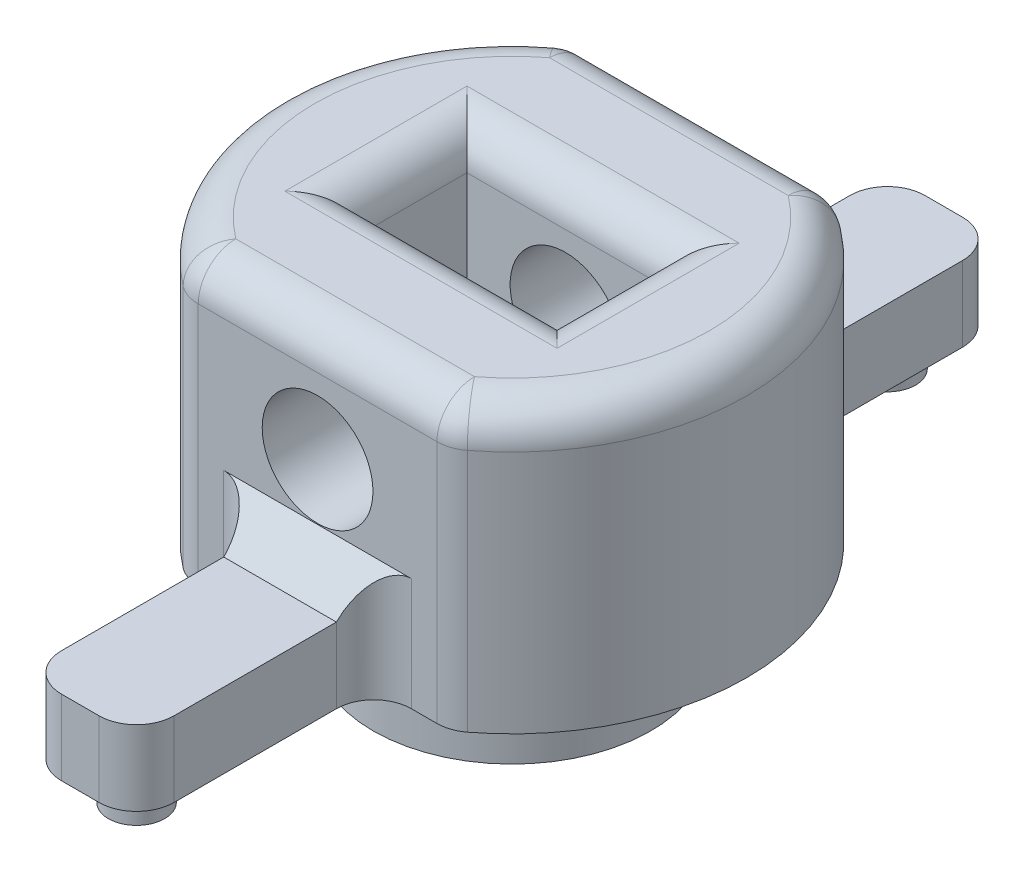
from build123d import *

# Parameters (mm, degrees)
SKETCH1_R               = 7.4
BOSS_EXTRUDE1_DEPTH     = 5
SKETCH1_3_R             = 12.5
BOSS_EXTRUDE2_DEPTH     = 15
CUT_EXTRUDE1_START      = -5
SKETCH1_4_R             = 1.5
CUT_EXTRUDE1_DEPTH      = 25
CUT_EXTRUDE2_DEPTH      = 24.184046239
CUT_EXTRUDE2_DEPTH_BACK = 24.184046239
SKETCH2_R               = 2.95
SKETCH3_W               = 14
SKETCH3_H               = 4.287684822
CUT_EXTRUDE3_DEPTH      = 20
SKETCH4_R               = 1.5
BOSS_EXTRUDE3_DEPTH     = 4
SKETCH4_6_R             = 1.5
BOSS_EXTRUDE4_DEPTH     = 2
CUT_EXTRUDE4_DEPTH      = 2.85
CUT_EXTRUDE4_DEPTH_BACK = 2.85
FILLET1_SIZE            = 2
FILLET2_R               = 2
FILLET3_R               = 2
SKETCH1_5_R             = 1.5
CUT_EXTRUDE5_DEPTH      = 31.170349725


with BuildPart() as part:
    # Sketch1 → Boss-Extrude1 (new body)
    with BuildSketch(Plane(origin=(0, 0, 0), x_dir=(1, 0, 0), z_dir=(0, 1, 0))):
        with Locations(Location((0, 0, 0), (0, 0, 270))):
            Circle(SKETCH1_R)
    extrude(amount=-BOSS_EXTRUDE1_DEPTH)

    # Sketch1_3 → Boss-Extrude2 (add)
    with BuildSketch(Plane(origin=(0, 0, 0), x_dir=(1, 0, 0), z_dir=(0, 1, 0))):
        with Locations(Location((0, 0, 0), (0, 0, 270))):
            Circle(SKETCH1_3_R)
    extrude(amount=BOSS_EXTRUDE2_DEPTH)

    # Sketch1_4 → Cut-Extrude1 (cut)
    with BuildSketch(Plane(origin=(0, 0, 0), x_dir=(1, 0, 0), z_dir=(0, 1, 0)).offset(CUT_EXTRUDE1_START)):
        with Locations(Location((0, 0, 0), (0, 0, 270))):
            Circle(SKETCH1_4_R)
    extrude(amount=CUT_EXTRUDE1_DEPTH, mode=Mode.SUBTRACT)

    # Sketch2 → Cut-Extrude2 (cut, two sides: drawn at the far end of the back side and taken through both)
    with BuildSketch(Plane.XY.offset(-CUT_EXTRUDE2_DEPTH_BACK)):
        with Locations(Location((0, 9, 0), (0, 0, 90.000000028))):
            Circle(SKETCH2_R)
    extrude(amount=CUT_EXTRUDE2_DEPTH + CUT_EXTRUDE2_DEPTH_BACK, mode=Mode.SUBTRACT)

    # Sketch3 → Cut-Extrude3 (cut)
    with BuildSketch(Plane(origin=(0, 15, 0), x_dir=(1, 0, 0), z_dir=(0, 1, 0))):
        with Locations((0, 12.5)):
            Rectangle(SKETCH3_W, SKETCH3_H)
        with Locations((0, -12.5)):
            Rectangle(SKETCH3_W, SKETCH3_H)
    extrude(amount=-CUT_EXTRUDE3_DEPTH, mode=Mode.SUBTRACT)

    # Sketch4 → Boss-Extrude3 (add)
    # profile 1 of 3: a face of its own
    with BuildSketch(Plane(origin=(0, 0, 0), x_dir=(1, 0, 0), z_dir=(0, 1, 0))):
        with BuildLine():
            Line((-1, 23), (1, 23))
            ThreePointArc((1, 23), (2.414213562, 22.414213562), (3, 21))
            Line((3, 21), (3, -21))
            ThreePointArc((3, -21), (2.414213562, -22.414213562), (1, -23))
            Line((1, -23), (-1, -23))
            ThreePointArc((-1, -23), (-2.414213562, -22.414213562), (-3, -21))
            Line((-3, -21), (-3, 21))
            ThreePointArc((-3, 21), (-2.414213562, 22.414213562), (-1, 23))
        make_face()
        with Locations((0, 20)):
            Circle(SKETCH4_R, mode=Mode.SUBTRACT)
        with Locations((0, -20)):
            Circle(SKETCH4_R, mode=Mode.SUBTRACT)
    # profile 2 of 3: a face of its own
    with BuildSketch(Plane(origin=(0, 0, 0), x_dir=(1, 0, 0), z_dir=(0, 1, 0))):
        with Locations((0, 20)):
            Circle(SKETCH4_R)
    # profile 3 of 3: a face of its own
    with BuildSketch(Plane(origin=(0, 0, 0), x_dir=(1, 0, 0), z_dir=(0, 1, 0))):
        with Locations((0, -20)):
            Circle(SKETCH4_R)
    extrude(amount=BOSS_EXTRUDE3_DEPTH)

    # Sketch4_6 → Boss-Extrude4 (add)
    with BuildSketch(Plane(origin=(0, 0, 0), x_dir=(1, 0, 0), z_dir=(0, 1, 0))):
        with Locations(Location((0, -20, 0), (0, 0, 270))):
            Circle(SKETCH4_6_R)
        with Locations(Location((0, 20, 0), (0, 0, 270))):
            Circle(SKETCH4_6_R)
    extrude(amount=-BOSS_EXTRUDE4_DEPTH)

    # Sketch5 → Cut-Extrude4 (cut, two sides: drawn at the far end of the back side and taken through both)
    with BuildSketch(Plane.XY.offset(-CUT_EXTRUDE4_DEPTH_BACK)):
        Polygon((-5.25, 5.968911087), (0, 2.937822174), (5.25, 5.968911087), (5.25, 12.031088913), (0.107695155, 15), (-0.107695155, 15), (-5.25, 12.031088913), align=None)
        Polygon((0.107695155, 15), (5.25, 12.031088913), (5.25, 15), align=None)
        Polygon((-5.25, 15), (-5.25, 12.031088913), (-0.107695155, 15), align=None)
        Polygon((-0.107695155, 15), (0.107695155, 15), (0, 15.062177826), align=None)
    extrude(amount=CUT_EXTRUDE4_DEPTH + CUT_EXTRUDE4_DEPTH_BACK, mode=Mode.SUBTRACT)

    # Fillet1
    fillet1_edges = [part.edges().sort_by_distance(p)[0] for p in [
        (0, 4, -10.356157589),
        (0, 4, 10.356157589),
    ]]
    chamfer(fillet1_edges, length=FILLET1_SIZE)

    # Fillet2
    fillet2_edges = [part.edges().sort_by_distance(p)[0] for p in [
        (7, 7.5, 10.356157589),
        (-7, 7.5, 10.356157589),
        (3, 3, 10.356157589),
        (-7, 7.5, -10.356157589),
        (7, 7.5, -10.356157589),
        (3, 3, -10.356157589),
        (-3, 3, -10.356157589),
        (-3, 3, 10.356157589),
    ]]
    fillet(fillet2_edges, radius=FILLET2_R)

    # Fillet3
    fillet3_edges = [part.edges().sort_by_distance(p)[0] for p in [
        (0, 15, -2.85),
        (5.25, 15, 0),
        (0, 15, 2.85),
        (-5.25, 15, 0),
        (0, 15, 10.356157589),
        (-12.5, 15, 0),
        (0, 15, -10.356157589),
        (12.5, 15, 0),
        (-6.997060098, 15, -10.251322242),
        (6.997060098, 15, -10.251322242),
        (6.997060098, 15, 10.251322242),
        (-6.997060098, 15, 10.251322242),
    ]]
    fillet(fillet3_edges, radius=FILLET3_R)

    # Sketch1_5 → Cut-Extrude5 (cut, through all)
    with BuildSketch(Plane(origin=(0, 0, 0), x_dir=(1, 0, 0), z_dir=(0, 1, 0))):
        with Locations(Location((0, 0, 0), (0, 0, 270))):
            Circle(SKETCH1_5_R)
    extrude(amount=CUT_EXTRUDE5_DEPTH, mode=Mode.SUBTRACT)


solid = part.part
